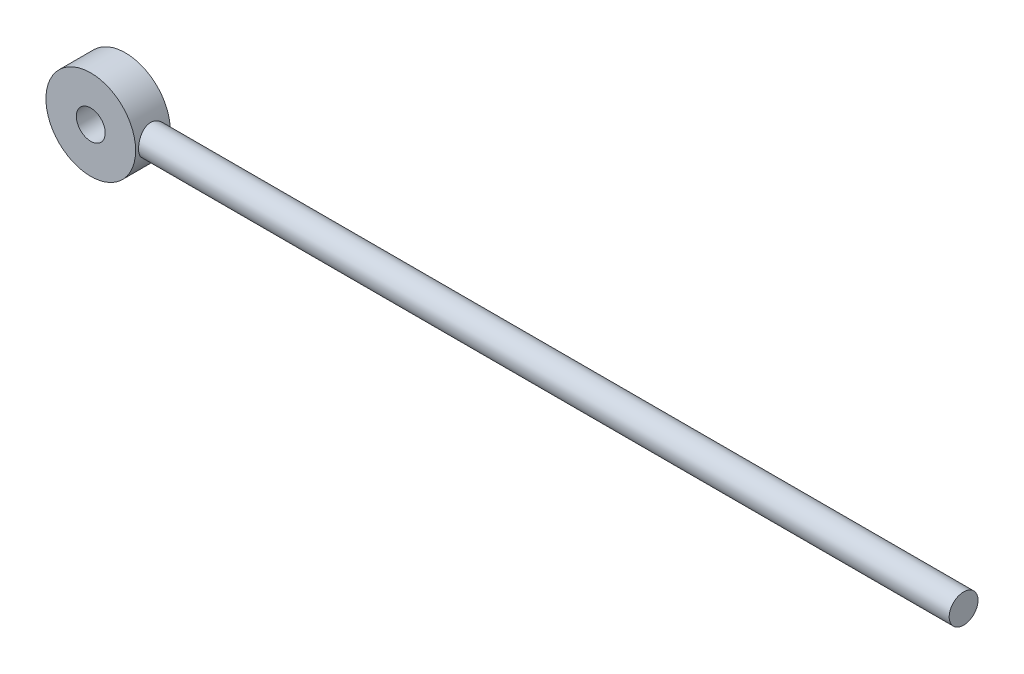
from build123d import *

# Parameters (mm, degrees)
SKETCH2_W           = 223.2856463
SKETCH2_H           = 3.9624
SKETCH3_R           = 12.319
SKETCH3_R_2         = 3.9624
BOSS_EXTRUDE1_DEPTH = 4.7625


with BuildPart() as part:
    # Sketch2 → Revolve1 (revolve)
    with BuildSketch(Plane.XY, mode=Mode.PRIVATE) as revolve1_sk:
        with Locations((123.30717685, 1.9812)):
            Rectangle(SKETCH2_W, SKETCH2_H)
    revolve(revolve1_sk.sketch.rotate(Axis((11.6643537, 0, 0), (1, 0, 0)), 90), axis=Axis((11.6643537, 0, 0), (1, 0, 0)))

    # Sketch3 → Boss-Extrude1 (add, symmetric)
    with BuildSketch(Plane.XY):
        Circle(SKETCH3_R)
        with Locations(Location((0, 0, 0), (0, 0, 180))):
            Circle(SKETCH3_R_2, mode=Mode.SUBTRACT)
    extrude(amount=BOSS_EXTRUDE1_DEPTH, both=True)


solid = part.part
